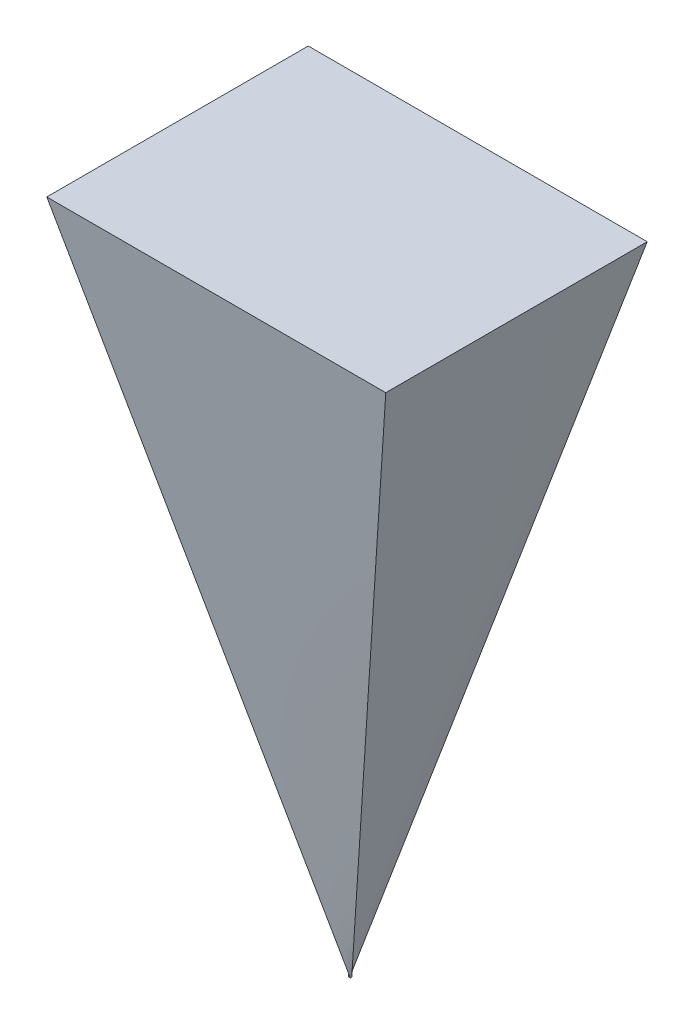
ISO-10303-21;
HEADER;
FILE_DESCRIPTION(('STEP AP214'),'2;1');
FILE_NAME('part.step','',(''),(''),'','','');
FILE_SCHEMA(('AUTOMOTIVE_DESIGN { 1 0 10303 214 1 1 1 1 }'));
ENDSEC;
DATA;
#1=APPLICATION_CONTEXT('core data for automotive mechanical design processes');
#2=APPLICATION_PROTOCOL_DEFINITION('international standard','automotive_design',2000,#1);
#3=PRODUCT_CONTEXT('',#1,'mechanical');
#4=PRODUCT('Part','Part','',(#3));
#5=PRODUCT_RELATED_PRODUCT_CATEGORY('part','',(#4));
#6=PRODUCT_DEFINITION_FORMATION('','',#4);
#7=PRODUCT_DEFINITION_CONTEXT('part definition',#1,'design');
#8=PRODUCT_DEFINITION('design','',#6,#7);
#9=PRODUCT_DEFINITION_SHAPE('','',#8);
#10=(LENGTH_UNIT() NAMED_UNIT(*) SI_UNIT(.MILLI.,.METRE.));
#11=(NAMED_UNIT(*) PLANE_ANGLE_UNIT() SI_UNIT($,.RADIAN.));
#12=(NAMED_UNIT(*) SI_UNIT($,.STERADIAN.) SOLID_ANGLE_UNIT());
#13=UNCERTAINTY_MEASURE_WITH_UNIT(LENGTH_MEASURE(1.E-05),#10,'distance_accuracy_value','');
#14=(GEOMETRIC_REPRESENTATION_CONTEXT(3) GLOBAL_UNCERTAINTY_ASSIGNED_CONTEXT((#13)) GLOBAL_UNIT_ASSIGNED_CONTEXT((#10,
#11,#12)) REPRESENTATION_CONTEXT('',''));
#15=CARTESIAN_POINT('',(0.,0.,0.));
#16=DIRECTION('',(0.,0.,1.));
#17=DIRECTION('',(1.,0.,0.));
#18=AXIS2_PLACEMENT_3D('',#15,#16,#17);
#19=CARTESIAN_POINT('',(1282.7,4978.4,1013.46));
#20=DIRECTION('',(0.,1.,0.));
#21=DIRECTION('',(0.,0.,1.));
#22=AXIS2_PLACEMENT_3D('',#19,#20,#21);
#23=PLANE('',#22);
#24=DIRECTION('',(0.,0.,-1.));
#25=VECTOR('',#24,1.);
#26=CARTESIAN_POINT('',(1282.7,4978.4,1013.46));
#27=LINE('',#26,#25);
#28=CARTESIAN_POINT('',(1282.7,4978.4,1013.46));
#29=VERTEX_POINT('',#28);
#30=CARTESIAN_POINT('',(1282.7,4978.4,-965.199999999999));
#31=VERTEX_POINT('',#30);
#32=EDGE_CURVE('E136',#29,#31,#27,.T.);
#33=ORIENTED_EDGE('',*,*,#32,.T.);
#34=DIRECTION('',(-1.,0.,0.));
#35=VECTOR('',#34,1.);
#36=CARTESIAN_POINT('',(1282.7,4978.4,-965.2));
#37=LINE('',#36,#35);
#38=CARTESIAN_POINT('',(-1282.7,4978.4,-965.2));
#39=VERTEX_POINT('',#38);
#40=EDGE_CURVE('E109',#31,#39,#37,.T.);
#41=ORIENTED_EDGE('',*,*,#40,.T.);
#42=DIRECTION('',(0.,0.,1.));
#43=VECTOR('',#42,1.);
#44=CARTESIAN_POINT('',(-1282.7,4978.4,1013.46));
#45=LINE('',#44,#43);
#46=CARTESIAN_POINT('',(-1282.7,4978.4,1013.46));
#47=VERTEX_POINT('',#46);
#48=EDGE_CURVE('E90',#39,#47,#45,.T.);
#49=ORIENTED_EDGE('',*,*,#48,.T.);
#50=DIRECTION('',(1.,0.,0.));
#51=VECTOR('',#50,1.);
#52=CARTESIAN_POINT('',(1282.7,4978.4,1013.46));
#53=LINE('',#52,#51);
#54=EDGE_CURVE('E81',#47,#29,#53,.T.);
#55=ORIENTED_EDGE('',*,*,#54,.T.);
#56=EDGE_LOOP('',(#33,#41,#49,#55));
#57=FACE_BOUND('',#56,.T.);
#58=ADVANCED_FACE('F42',(#57),#23,.T.);
#59=CARTESIAN_POINT('',(-6.477,0.,5.334));
#60=DIRECTION('',(0.,1.,0.));
#61=DIRECTION('',(0.,0.,1.));
#62=AXIS2_PLACEMENT_3D('',#59,#60,#61);
#63=PLANE('',#62);
#64=DIRECTION('',(0.,0.,1.));
#65=VECTOR('',#64,1.);
#66=CARTESIAN_POINT('',(-6.477,0.,-5.3086));
#67=LINE('',#66,#65);
#68=CARTESIAN_POINT('',(-6.477,0.,-5.3086));
#69=VERTEX_POINT('',#68);
#70=CARTESIAN_POINT('',(-6.477,0.,5.334));
#71=VERTEX_POINT('',#70);
#72=EDGE_CURVE('E199',#69,#71,#67,.T.);
#73=ORIENTED_EDGE('',*,*,#72,.F.);
#74=DIRECTION('',(-1.,0.,0.));
#75=VECTOR('',#74,1.);
#76=CARTESIAN_POINT('',(-6.477,0.,-5.3086));
#77=LINE('',#76,#75);
#78=CARTESIAN_POINT('',(6.477,0.,-5.3086));
#79=VERTEX_POINT('',#78);
#80=EDGE_CURVE('E12',#79,#69,#77,.T.);
#81=ORIENTED_EDGE('',*,*,#80,.F.);
#82=DIRECTION('',(0.,0.,-1.));
#83=VECTOR('',#82,1.);
#84=CARTESIAN_POINT('',(6.477,0.,-5.3086));
#85=LINE('',#84,#83);
#86=CARTESIAN_POINT('',(6.477,0.,5.334));
#87=VERTEX_POINT('',#86);
#88=EDGE_CURVE('E53',#87,#79,#85,.T.);
#89=ORIENTED_EDGE('',*,*,#88,.F.);
#90=DIRECTION('',(1.,0.,0.));
#91=VECTOR('',#90,1.);
#92=CARTESIAN_POINT('',(-6.477,0.,5.334));
#93=LINE('',#92,#91);
#94=EDGE_CURVE('E62',#71,#87,#93,.T.);
#95=ORIENTED_EDGE('',*,*,#94,.F.);
#96=EDGE_LOOP('',(#73,#81,#89,#95));
#97=FACE_BOUND('',#96,.T.);
#98=ADVANCED_FACE('F221',(#97),#63,.F.);
#99=CARTESIAN_POINT('',(6.477,0.,5.334));
#100=CARTESIAN_POINT('',(-1282.7,4978.4,1013.46));
#101=CARTESIAN_POINT('',(6.477,0.,3.56023333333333));
#102=CARTESIAN_POINT('',(-855.133333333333,4978.4,1013.46));
#103=CARTESIAN_POINT('',(6.477,0.,1.78646666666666));
#104=CARTESIAN_POINT('',(-427.566666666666,4978.4,1013.46));
#105=CARTESIAN_POINT('',(6.477,0.,-1.76106666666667));
#106=CARTESIAN_POINT('',(427.566666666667,4978.4,1013.46));
#107=CARTESIAN_POINT('',(6.477,0.,-3.53483333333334));
#108=CARTESIAN_POINT('',(855.133333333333,4978.4,1013.46));
#109=CARTESIAN_POINT('',(6.477,0.,-5.3086));
#110=CARTESIAN_POINT('',(1282.7,4978.4,1013.46));
#111=B_SPLINE_SURFACE_WITH_KNOTS('',3,1,((#99,#100),(#101,#102),(#103,#104),(#105,#106),(#107,
#108),(#109,#110)),.UNSPECIFIED.,.F.,.F.,.F.,(4,2,4),(2,2),(0.,0.5,1.),(0.,1.),.UNSPECIFIED.);
#112=DIRECTION('',(0.243582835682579,0.950188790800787,0.194444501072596));
#113=VECTOR('',#112,1.);
#114=CARTESIAN_POINT('',(644.5885,2489.2,504.0757));
#115=LINE('',#114,#113);
#116=EDGE_CURVE('E96',#79,#29,#115,.T.);
#117=DIRECTION('',(0.246003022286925,-0.949987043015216,-0.192372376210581));
#118=VECTOR('',#117,1.);
#119=CARTESIAN_POINT('',(-638.111499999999,2489.2,509.397));
#120=LINE('',#119,#118);
#121=EDGE_CURVE('E87',#47,#87,#120,.T.);
#122=ORIENTED_EDGE('',*,*,#88,.T.);
#123=ORIENTED_EDGE('',*,*,#116,.T.);
#124=ORIENTED_EDGE('',*,*,#54,.F.);
#125=ORIENTED_EDGE('',*,*,#121,.T.);
#126=EDGE_LOOP('',(#122,#123,#124,#125));
#127=FACE_BOUND('',#126,.T.);
#128=ADVANCED_FACE('F101',(#127),#111,.T.);
#129=CARTESIAN_POINT('',(6.477,0.,-5.3086));
#130=CARTESIAN_POINT('',(1282.7,4978.4,1013.46));
#131=CARTESIAN_POINT('',(4.31800000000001,0.,-5.3086));
#132=CARTESIAN_POINT('',(1282.7,4978.4,683.683333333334));
#133=CARTESIAN_POINT('',(2.15900000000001,0.,-5.3086));
#134=CARTESIAN_POINT('',(1282.7,4978.4,353.906666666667));
#135=CARTESIAN_POINT('',(-2.15899999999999,0.,-5.3086));
#136=CARTESIAN_POINT('',(1282.7,4978.4,-305.646666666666));
#137=CARTESIAN_POINT('',(-4.31799999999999,0.,-5.3086));
#138=CARTESIAN_POINT('',(1282.7,4978.4,-635.423333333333));
#139=CARTESIAN_POINT('',(-6.477,0.,-5.3086));
#140=CARTESIAN_POINT('',(1282.7,4978.4,-965.199999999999));
#141=B_SPLINE_SURFACE_WITH_KNOTS('',3,1,((#129,#130),(#131,#132),(#133,#134),(#135,#136),(#137,
#138),(#139,#140)),.UNSPECIFIED.,.F.,.F.,.F.,(4,2,4),(2,2),(0.,0.5,1.),(0.,1.),.UNSPECIFIED.);
#142=DIRECTION('',(0.246429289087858,0.951633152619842,-0.183485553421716));
#143=VECTOR('',#142,1.);
#144=CARTESIAN_POINT('',(638.1115,2489.2,-485.2543));
#145=LINE('',#144,#143);
#146=EDGE_CURVE('E97',#69,#31,#145,.T.);
#147=ORIENTED_EDGE('',*,*,#80,.T.);
#148=ORIENTED_EDGE('',*,*,#146,.T.);
#149=ORIENTED_EDGE('',*,*,#32,.F.);
#150=ORIENTED_EDGE('',*,*,#116,.F.);
#151=EDGE_LOOP('',(#147,#148,#149,#150));
#152=FACE_BOUND('',#151,.T.);
#153=ADVANCED_FACE('F155',(#152),#141,.T.);
#154=CARTESIAN_POINT('',(-6.477,0.,5.334));
#155=CARTESIAN_POINT('',(-1282.7,4978.4,-965.199999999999));
#156=CARTESIAN_POINT('',(-4.318,0.,5.334));
#157=CARTESIAN_POINT('',(-1282.7,4978.4,-635.423333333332));
#158=CARTESIAN_POINT('',(-2.159,0.,5.334));
#159=CARTESIAN_POINT('',(-1282.7,4978.4,-305.646666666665));
#160=CARTESIAN_POINT('',(2.159,0.,5.334));
#161=CARTESIAN_POINT('',(-1282.7,4978.4,353.906666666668));
#162=CARTESIAN_POINT('',(4.318,0.,5.334));
#163=CARTESIAN_POINT('',(-1282.7,4978.4,683.683333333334));
#164=CARTESIAN_POINT('',(6.477,0.,5.334));
#165=CARTESIAN_POINT('',(-1282.7,4978.4,1013.46));
#166=B_SPLINE_SURFACE_WITH_KNOTS('',3,1,((#154,#155),(#156,#157),(#158,#159),(#160,#161),(#162,
#163),(#164,#165)),.UNSPECIFIED.,.F.,.F.,.F.,(4,2,4),(2,2),(0.,0.5,1.),(0.,1.),.UNSPECIFIED.);
#167=DIRECTION('',(-0.244009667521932,0.951853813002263,-0.18556292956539));
#168=VECTOR('',#167,1.);
#169=CARTESIAN_POINT('',(-644.5885,2489.2,-479.933));
#170=LINE('',#169,#168);
#171=EDGE_CURVE('E103',#71,#39,#170,.T.);
#172=ORIENTED_EDGE('',*,*,#94,.T.);
#173=ORIENTED_EDGE('',*,*,#121,.F.);
#174=ORIENTED_EDGE('',*,*,#48,.F.);
#175=ORIENTED_EDGE('',*,*,#171,.F.);
#176=EDGE_LOOP('',(#172,#173,#174,#175));
#177=FACE_BOUND('',#176,.T.);
#178=ADVANCED_FACE('F88',(#177),#166,.T.);
#179=CARTESIAN_POINT('',(-6.477,0.,-5.3086));
#180=CARTESIAN_POINT('',(1282.7,4978.4,-965.2));
#181=CARTESIAN_POINT('',(-6.477,0.,-3.53483333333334));
#182=CARTESIAN_POINT('',(855.133333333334,4978.4,-965.2));
#183=CARTESIAN_POINT('',(-6.477,0.,-1.76106666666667));
#184=CARTESIAN_POINT('',(427.566666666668,4978.4,-965.2));
#185=CARTESIAN_POINT('',(-6.477,0.,1.78646666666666));
#186=CARTESIAN_POINT('',(-427.566666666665,4978.4,-965.2));
#187=CARTESIAN_POINT('',(-6.477,0.,3.56023333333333));
#188=CARTESIAN_POINT('',(-855.133333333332,4978.4,-965.2));
#189=CARTESIAN_POINT('',(-6.477,0.,5.334));
#190=CARTESIAN_POINT('',(-1282.7,4978.4,-965.2));
#191=B_SPLINE_SURFACE_WITH_KNOTS('',3,1,((#179,#180),(#181,#182),(#183,#184),(#185,#186),(#187,
#188),(#189,#190)),.UNSPECIFIED.,.F.,.F.,.F.,(4,2,4),(2,2),(0.,0.5,1.),(0.,1.),.UNSPECIFIED.);
#192=ORIENTED_EDGE('',*,*,#72,.T.);
#193=ORIENTED_EDGE('',*,*,#171,.T.);
#194=ORIENTED_EDGE('',*,*,#40,.F.);
#195=ORIENTED_EDGE('',*,*,#146,.F.);
#196=EDGE_LOOP('',(#192,#193,#194,#195));
#197=FACE_BOUND('',#196,.T.);
#198=ADVANCED_FACE('F211',(#197),#191,.T.);
#199=CLOSED_SHELL('',(#58,#98,#128,#153,#178,#198));
#200=MANIFOLD_SOLID_BREP('B2',#199);
#201=ADVANCED_BREP_SHAPE_REPRESENTATION('',(#18,#200),#14);
#202=SHAPE_DEFINITION_REPRESENTATION(#9,#201);
ENDSEC;
END-ISO-10303-21;
